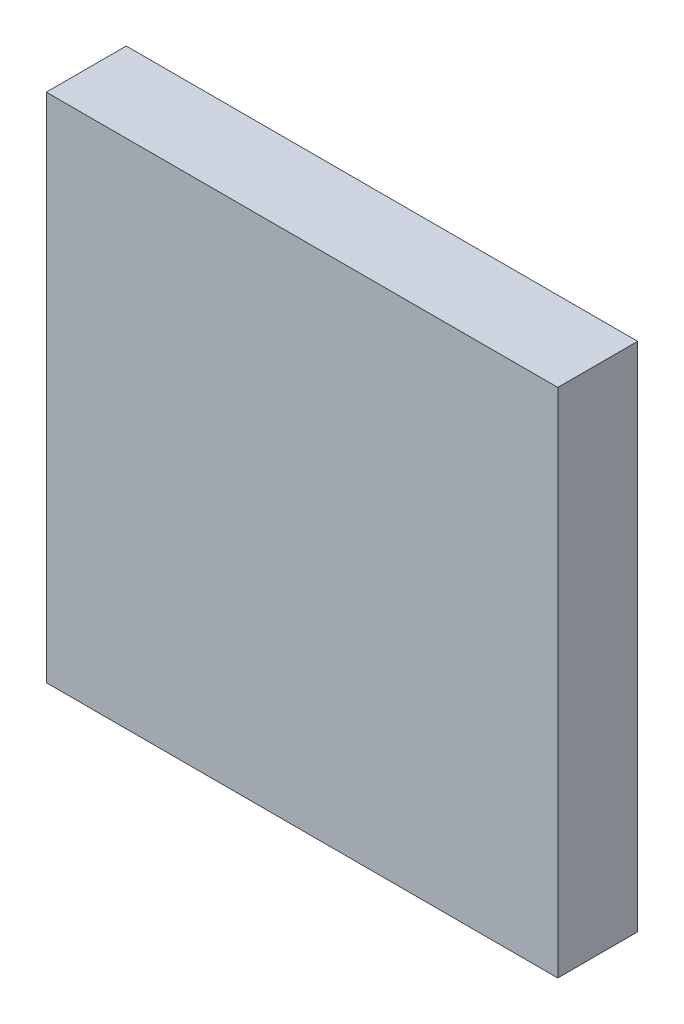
from build123d import *

# Parameters (mm, degrees)
SKETCH1_W      = 80
SKETCH1_H      = 80
EXTRUDE1_DEPTH = 12.5


with BuildPart() as part:
    # Sketch1 → Extrude1 (new body)
    with BuildSketch(Plane.XY):
        with Locations((40, 40)):
            Rectangle(SKETCH1_W, SKETCH1_H)
    extrude(amount=EXTRUDE1_DEPTH)


solid = part.part
